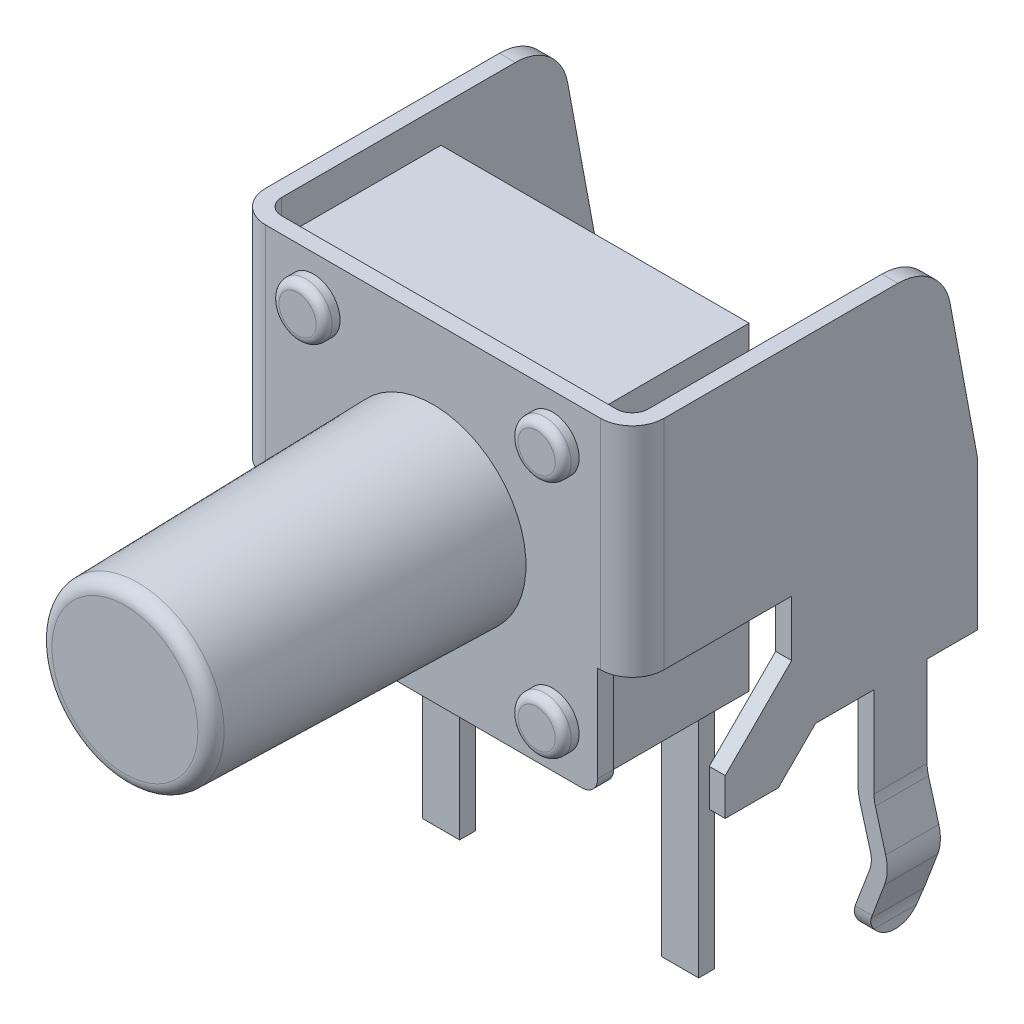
from build123d import *

# Parameters (mm, degrees)
EXTRUDE_1_DEPTH      = 2.25
EXTRUDE_1_DEPTH_BACK = 0.5
SKETCH_1_W           = 5.8
SKETCH_1_H           = 6
EXTRUDE_2_DEPTH      = 7.1
EXTRUDE_3_DEPTH      = 3.95
CUT_EXTRUDE_START    = 3.2
CUT_EXTRUDE_1_DEPTH  = 6.856075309
CUT_EXTRUDE_2_REACH  = 12.424
EXTRUDE_4_DEPTH      = 1
EXTRUDE_4_DEPTH_BACK = 3.5
SKETCH_6_W           = 0.7
SKETCH_6_H           = 0.3
SKETCH_7_R           = 1.75
EXTRUDE_5_DEPTH      = 5.8
EXTRUDE_5_TAPER      = 1.3
SKETCH_8_R           = 0.5
EXTRUDE_6_DEPTH      = 0.3
FILLET_1_R           = 0.15
FILLET_2_R           = 0.25


with BuildPart() as part:
    # Sketch 1 → Extrude 1 (new, two sides: drawn at the far end of the back side and taken through both)
    with BuildSketch(Plane.XY.offset(-EXTRUDE_1_DEPTH_BACK)):
        with Locations((0, 4)):
            Rectangle(SKETCH_1_W, SKETCH_1_H)
    extrude(amount=EXTRUDE_1_DEPTH + EXTRUDE_1_DEPTH_BACK)

    # Sketch 2 → Extrude 2 (add)
    with BuildSketch(Plane(origin=(0, 0, 0), x_dir=(1, 0, 0), z_dir=(0, 1, 0))):
        with BuildLine():
            Line((-3.15, -2.25), (3.15, -2.25))
            ThreePointArc((3.15, -2.25), (3.362132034, -2.162132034), (3.45, -1.95))
            Line((3.45, -1.95), (3.45, 3.95))
            Line((3.45, 3.95), (3.75, 3.95))
            Line((3.75, 3.95), (3.75, -1.95))
            ThreePointArc((3.75, -1.95), (3.574264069, -2.374264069), (3.15, -2.55))
            Line((3.15, -2.55), (-3.15, -2.55))
            ThreePointArc((-3.15, -2.55), (-3.574264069, -2.374264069), (-3.75, -1.95))
            Line((-3.75, -1.95), (-3.75, 3.95))
            Line((-3.75, 3.95), (-3.45, 3.95))
            Line((-3.45, 3.95), (-3.45, -1.95))
            ThreePointArc((-3.45, -1.95), (-3.362132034, -2.162132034), (-3.15, -2.25))
        make_face()
    extrude(amount=EXTRUDE_2_DEPTH)

    # Sketch 3 → Extrude 3 (add)
    with BuildSketch(Plane.XY):
        with BuildLine():
            Line((3.45, 0), (3.45, -1))
            ThreePointArc((3.45, -1), (3.459274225, -1.135876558), (3.486924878, -1.269232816))
            Line((3.486924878, -1.269232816), (3.681537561, -1.965383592))
            ThreePointArc((3.681537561, -1.965383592), (3.699507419, -2.1221887), (3.667704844, -2.276782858))
            Line((3.667704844, -2.276782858), (3.414590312, -2.946434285))
            ThreePointArc((3.414590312, -2.946434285), (3.366280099, -3.12029147), (3.35, -3.3))
            Line((3.35, -3.3), (3.35, -3.5))
            Line((3.35, -3.5), (3.65, -3.5))
            Line((3.65, -3.5), (3.65, -3.3))
            ThreePointArc((3.65, -3.3), (3.661396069, -3.174204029), (3.695213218, -3.052503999))
            Line((3.695213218, -3.052503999), (3.948327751, -2.382852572))
            ThreePointArc((3.948327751, -2.382852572), (3.99921187, -2.135501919), (3.970460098, -1.884613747))
            Line((3.970460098, -1.884613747), (3.775847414, -1.188462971))
            ThreePointArc((3.775847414, -1.188462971), (3.756491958, -1.09511359), (3.75, -1))
            Line((3.75, -1), (3.75, 0))
            Line((3.75, 0), (3.45, 0))
        make_face()
        with BuildLine():
            Line((-3.65, -3.5), (-3.35, -3.5))
            Line((-3.35, -3.5), (-3.35, -3.3))
            ThreePointArc((-3.35, -3.3), (-3.366280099, -3.12029147), (-3.414590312, -2.946434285))
            Line((-3.414590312, -2.946434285), (-3.667704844, -2.276782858))
            ThreePointArc((-3.667704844, -2.276782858), (-3.699507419, -2.1221887), (-3.681537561, -1.965383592))
            Line((-3.681537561, -1.965383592), (-3.486924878, -1.269232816))
            ThreePointArc((-3.486924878, -1.269232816), (-3.459274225, -1.135876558), (-3.45, -1))
            Line((-3.45, -1), (-3.45, 0))
            Line((-3.45, 0), (-3.75, 0))
            Line((-3.75, 0), (-3.75, -1))
            ThreePointArc((-3.75, -1), (-3.756491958, -1.09511359), (-3.775847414, -1.188462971))
            Line((-3.775847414, -1.188462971), (-3.970460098, -1.884613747))
            ThreePointArc((-3.970460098, -1.884613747), (-3.99921187, -2.135501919), (-3.948327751, -2.382852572))
            Line((-3.948327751, -2.382852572), (-3.695213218, -3.052503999))
            ThreePointArc((-3.695213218, -3.052503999), (-3.661396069, -3.174204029), (-3.65, -3.3))
            Line((-3.65, -3.3), (-3.65, -3.5))
        make_face()
    extrude(amount=-EXTRUDE_3_DEPTH)

    # Sketch 4 → Cut-Extrude 1 (cut, through all)
    with BuildSketch(Plane(origin=(0, 0, 0), x_dir=(0, 0, -1), z_dir=(1, 0, 0)).offset(CUT_EXTRUDE_START)):
        with BuildLine():
            Line((-2.55, -4.5), (-2.55, 3))
            Line((-2.55, 3), (0.45, 3))
            Line((0.45, 3), (0.45, 1.95))
            Line((0.45, 1.95), (-0.8, 0.7))
            Line((-0.8, 0.7), (-0.8, 0))
            Line((-0.8, 0), (0.2, 0))
            Line((0.2, 0), (0.9, 0.7))
            Line((0.9, 0.7), (2, 0.7))
            Line((2, 0.7), (2, -3))
            ThreePointArc((2, -3), (2.5, -3.5), (3, -3))
            Line((3, -3), (3, 0.7))
            Line((3, 0.7), (3.95, 0.7))
            Line((3.95, 0.7), (3.95, -4.5))
            Line((3.95, -4.5), (-2.55, -4.5))
        make_face()
        with BuildLine():
            Line((3.95, 3.5), (3.433185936, 6.282607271))
            ThreePointArc((3.433185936, 6.282607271), (3.089293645, 6.868962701), (2.45, 7.1))
            Line((2.45, 7.1), (3.95, 7.1))
            Line((3.95, 7.1), (3.95, 3.5))
        make_face()
    cut_extrude_1 = extrude(amount=CUT_EXTRUDE_1_DEPTH, mode=Mode.SUBTRACT)

    # Mirror 1: Cut-Extrude 1 across plane
    add(cut_extrude_1.mirror(Plane(origin=(0, 0, 0), x_dir=(0, 0, 1), z_dir=(1, 0, 0))), mode=Mode.SUBTRACT)

    # Sketch 5 → Cut-Extrude 2 (cut, up to next)
    with BuildSketch(Plane.XY.offset(2.55), mode=Mode.PRIVATE) as cut_extrude_2_sk1:
        with BuildLine():
            Line((-3.1, 3), (-3.2, 3))
            Line((-3.2, 3), (-3.2, 0))
            Line((-3.2, 0), (3.2, 0))
            Line((3.2, 0), (3.2, 3))
            Line((3.2, 3), (3.1, 3))
            Line((3.1, 3), (3.1, 1.2))
            ThreePointArc((3.1, 1.2), (3.012132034, 0.987867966), (2.8, 0.9))
            Line((2.8, 0.9), (-2.8, 0.9))
            ThreePointArc((-2.8, 0.9), (-3.012132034, 0.987867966), (-3.1, 1.2))
            Line((-3.1, 1.2), (-3.1, 3))
        make_face()
    cut_extrude_2_tool1 = extrude(cut_extrude_2_sk1.sketch, amount=-CUT_EXTRUDE_2_REACH, mode=Mode.PRIVATE) & part.part
    add(cut_extrude_2_tool1.solids().sort_by_distance((0, 0.55452, 2.55))[0], mode=Mode.SUBTRACT)

    # Sketch 6 → Extrude 4 (add, two sides: drawn at the far end of the back side and taken through both)
    with BuildSketch(Plane(origin=(0, 0, 0), x_dir=(1, 0, 0), z_dir=(0, 1, 0)).offset(-EXTRUDE_4_DEPTH_BACK)):
        with Locations((-2.25, 0)):
            Rectangle(SKETCH_6_W, SKETCH_6_H)
        with Locations((2.25, 0)):
            Rectangle(SKETCH_6_W, SKETCH_6_H)
    extrude(amount=EXTRUDE_4_DEPTH + EXTRUDE_4_DEPTH_BACK)

    # Sketch 7 → Extrude 5 (add)
    with BuildSketch(Plane.XY.offset(2.55)):
        with Locations((0, 4)):
            Circle(SKETCH_7_R)
    extrude(amount=EXTRUDE_5_DEPTH, taper=EXTRUDE_5_TAPER)

    # Sketch 8 → Extrude 6 (add)
    with BuildSketch(Plane.XY.offset(2.55)):
        with Locations(Location((-2.25, 6.25, 0), (0, 0, 180))):
            Circle(SKETCH_8_R)
        with Locations(Location((2.25, 6.25, 0), (0, 0, 180))):
            Circle(SKETCH_8_R)
        with Locations(Location((-2.25, 1.75, 0), (0, 0, 180))):
            Circle(SKETCH_8_R)
        with Locations(Location((2.25, 1.75, 0), (0, 0, 180))):
            Circle(SKETCH_8_R)
    extrude(amount=EXTRUDE_6_DEPTH)

    # Fillet 1
    fillet_1_edges = [part.edges().sort_by_distance(p)[0] for p in [
        (-1.75, 6.25, 2.85),
        (2.75, 6.25, 2.85),
        (-1.75, 1.75, 2.85),
        (2.75, 1.75, 2.85),
    ]]
    fillet(fillet_1_edges, radius=FILLET_1_R)

    # Fillet 2
    fillet_2_edges = [part.edges().sort_by_distance(p)[0] for p in [
        (-1.618379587, 4, 8.35),
    ]]
    fillet(fillet_2_edges, radius=FILLET_2_R)


solid = part.part
